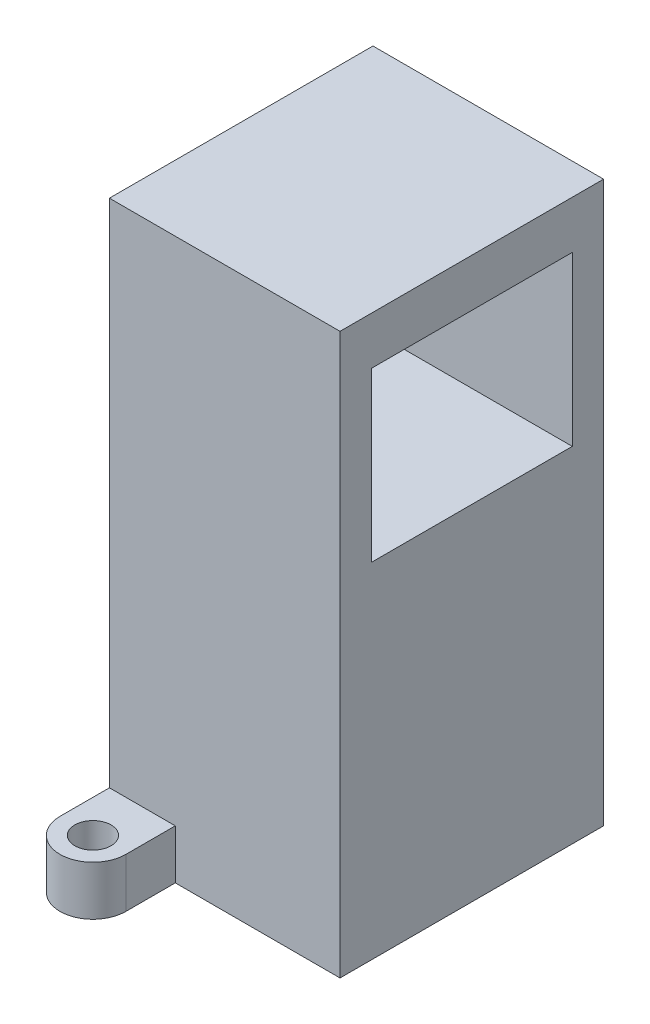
ISO-10303-21;
HEADER;
FILE_DESCRIPTION(('STEP AP214'),'2;1');
FILE_NAME('part.step','',(''),(''),'','','');
FILE_SCHEMA(('AUTOMOTIVE_DESIGN { 1 0 10303 214 1 1 1 1 }'));
ENDSEC;
DATA;
#1=APPLICATION_CONTEXT('core data for automotive mechanical design processes');
#2=APPLICATION_PROTOCOL_DEFINITION('international standard','automotive_design',2000,#1);
#3=PRODUCT_CONTEXT('',#1,'mechanical');
#4=PRODUCT('Part','Part','',(#3));
#5=PRODUCT_RELATED_PRODUCT_CATEGORY('part','',(#4));
#6=PRODUCT_DEFINITION_FORMATION('','',#4);
#7=PRODUCT_DEFINITION_CONTEXT('part definition',#1,'design');
#8=PRODUCT_DEFINITION('design','',#6,#7);
#9=PRODUCT_DEFINITION_SHAPE('','',#8);
#10=(LENGTH_UNIT() NAMED_UNIT(*) SI_UNIT(.MILLI.,.METRE.));
#11=(NAMED_UNIT(*) PLANE_ANGLE_UNIT() SI_UNIT($,.RADIAN.));
#12=(NAMED_UNIT(*) SI_UNIT($,.STERADIAN.) SOLID_ANGLE_UNIT());
#13=UNCERTAINTY_MEASURE_WITH_UNIT(LENGTH_MEASURE(1.E-05),#10,'distance_accuracy_value','');
#14=(GEOMETRIC_REPRESENTATION_CONTEXT(3) GLOBAL_UNCERTAINTY_ASSIGNED_CONTEXT((#13)) GLOBAL_UNIT_ASSIGNED_CONTEXT((#10,
#11,#12)) REPRESENTATION_CONTEXT('',''));
#15=CARTESIAN_POINT('',(0.,0.,0.));
#16=DIRECTION('',(0.,0.,1.));
#17=DIRECTION('',(1.,0.,0.));
#18=AXIS2_PLACEMENT_3D('',#15,#16,#17);
#19=CARTESIAN_POINT('',(-7.,34.,-8.));
#20=DIRECTION('',(0.,0.,1.));
#21=DIRECTION('',(1.,0.,0.));
#22=AXIS2_PLACEMENT_3D('',#19,#20,#21);
#23=PLANE('',#22);
#24=DIRECTION('',(0.,-1.,0.));
#25=VECTOR('',#24,1.);
#26=CARTESIAN_POINT('',(-3.,3.,-8.));
#27=LINE('',#26,#25);
#28=CARTESIAN_POINT('',(-3.,3.,-8.));
#29=VERTEX_POINT('',#28);
#30=CARTESIAN_POINT('',(-3.,0.,-8.));
#31=VERTEX_POINT('',#30);
#32=EDGE_CURVE('E217',#29,#31,#27,.T.);
#33=ORIENTED_EDGE('',*,*,#32,.F.);
#34=DIRECTION('',(1.,0.,0.));
#35=VECTOR('',#34,1.);
#36=CARTESIAN_POINT('',(-3.,3.,-8.));
#37=LINE('',#36,#35);
#38=CARTESIAN_POINT('',(-7.,3.,-8.));
#39=VERTEX_POINT('',#38);
#40=EDGE_CURVE('E59',#39,#29,#37,.T.);
#41=ORIENTED_EDGE('',*,*,#40,.F.);
#42=DIRECTION('',(0.,-1.,0.));
#43=VECTOR('',#42,1.);
#44=CARTESIAN_POINT('',(-7.,34.,-8.));
#45=LINE('',#44,#43);
#46=CARTESIAN_POINT('',(-7.,34.,-8.));
#47=VERTEX_POINT('',#46);
#48=EDGE_CURVE('E44',#47,#39,#45,.T.);
#49=ORIENTED_EDGE('',*,*,#48,.F.);
#50=DIRECTION('',(-1.,0.,0.));
#51=VECTOR('',#50,1.);
#52=CARTESIAN_POINT('',(-7.,34.,-8.));
#53=LINE('',#52,#51);
#54=CARTESIAN_POINT('',(7.,34.,-8.));
#55=VERTEX_POINT('',#54);
#56=EDGE_CURVE('E182',#55,#47,#53,.T.);
#57=ORIENTED_EDGE('',*,*,#56,.F.);
#58=DIRECTION('',(0.,-1.,0.));
#59=VECTOR('',#58,1.);
#60=CARTESIAN_POINT('',(7.,34.,-8.));
#61=LINE('',#60,#59);
#62=CARTESIAN_POINT('',(7.,0.,-8.));
#63=VERTEX_POINT('',#62);
#64=EDGE_CURVE('E11',#55,#63,#61,.T.);
#65=ORIENTED_EDGE('',*,*,#64,.T.);
#66=DIRECTION('',(-1.,0.,0.));
#67=VECTOR('',#66,1.);
#68=CARTESIAN_POINT('',(-7.,0.,-8.));
#69=LINE('',#68,#67);
#70=EDGE_CURVE('E173',#63,#31,#69,.T.);
#71=ORIENTED_EDGE('',*,*,#70,.T.);
#72=EDGE_LOOP('',(#33,#41,#49,#57,#65,#71));
#73=FACE_BOUND('',#72,.T.);
#74=ADVANCED_FACE('F36',(#73),#23,.F.);
#75=CARTESIAN_POINT('',(7.,34.,-8.));
#76=DIRECTION('',(-1.,0.,0.));
#77=DIRECTION('',(0.,0.,1.));
#78=AXIS2_PLACEMENT_3D('',#75,#76,#77);
#79=PLANE('',#78);
#80=DIRECTION('',(0.,0.,1.));
#81=VECTOR('',#80,1.);
#82=CARTESIAN_POINT('',(7.00000000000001,31.1,6.1));
#83=LINE('',#82,#81);
#84=CARTESIAN_POINT('',(7.,31.1,-6.1));
#85=VERTEX_POINT('',#84);
#86=CARTESIAN_POINT('',(7.00000000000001,31.1,6.1));
#87=VERTEX_POINT('',#86);
#88=EDGE_CURVE('E212',#85,#87,#83,.T.);
#89=ORIENTED_EDGE('',*,*,#88,.F.);
#90=DIRECTION('',(0.,1.,0.));
#91=VECTOR('',#90,1.);
#92=CARTESIAN_POINT('',(7.00000000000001,31.1,-6.1));
#93=LINE('',#92,#91);
#94=CARTESIAN_POINT('',(7.00000000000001,20.9,-6.1));
#95=VERTEX_POINT('',#94);
#96=EDGE_CURVE('E215',#95,#85,#93,.T.);
#97=ORIENTED_EDGE('',*,*,#96,.F.);
#98=DIRECTION('',(0.,0.,-1.));
#99=VECTOR('',#98,1.);
#100=CARTESIAN_POINT('',(7.00000000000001,20.9,6.1));
#101=LINE('',#100,#99);
#102=CARTESIAN_POINT('',(7.00000000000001,20.9,6.1));
#103=VERTEX_POINT('',#102);
#104=EDGE_CURVE('E206',#103,#95,#101,.T.);
#105=ORIENTED_EDGE('',*,*,#104,.F.);
#106=DIRECTION('',(0.,-1.,0.));
#107=VECTOR('',#106,1.);
#108=CARTESIAN_POINT('',(7.00000000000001,31.1,6.1));
#109=LINE('',#108,#107);
#110=EDGE_CURVE('E209',#87,#103,#109,.T.);
#111=ORIENTED_EDGE('',*,*,#110,.F.);
#112=EDGE_LOOP('',(#89,#97,#105,#111));
#113=FACE_BOUND('',#112,.T.);
#114=DIRECTION('',(0.,0.,-1.));
#115=VECTOR('',#114,1.);
#116=CARTESIAN_POINT('',(7.,0.,-8.));
#117=LINE('',#116,#115);
#118=CARTESIAN_POINT('',(7.00000000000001,0.,8.));
#119=VERTEX_POINT('',#118);
#120=EDGE_CURVE('E175',#119,#63,#117,.T.);
#121=ORIENTED_EDGE('',*,*,#120,.T.);
#122=ORIENTED_EDGE('',*,*,#64,.F.);
#123=DIRECTION('',(0.,0.,-1.));
#124=VECTOR('',#123,1.);
#125=CARTESIAN_POINT('',(7.,34.,-8.));
#126=LINE('',#125,#124);
#127=CARTESIAN_POINT('',(7.00000000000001,34.,8.));
#128=VERTEX_POINT('',#127);
#129=EDGE_CURVE('E170',#128,#55,#126,.T.);
#130=ORIENTED_EDGE('',*,*,#129,.F.);
#131=DIRECTION('',(0.,-1.,0.));
#132=VECTOR('',#131,1.);
#133=CARTESIAN_POINT('',(7.00000000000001,34.,8.));
#134=LINE('',#133,#132);
#135=EDGE_CURVE('E163',#128,#119,#134,.T.);
#136=ORIENTED_EDGE('',*,*,#135,.T.);
#137=EDGE_LOOP('',(#121,#122,#130,#136));
#138=FACE_BOUND('',#137,.T.);
#139=ADVANCED_FACE('F38',(#113,#138),#79,.F.);
#140=CARTESIAN_POINT('',(-7.,34.,-8.));
#141=DIRECTION('',(1.,0.,0.));
#142=DIRECTION('',(0.,0.,-1.));
#143=AXIS2_PLACEMENT_3D('',#140,#141,#142);
#144=PLANE('',#143);
#145=DIRECTION('',(0.,0.,-1.));
#146=VECTOR('',#145,1.);
#147=CARTESIAN_POINT('',(-7.,20.9,6.1));
#148=LINE('',#147,#146);
#149=CARTESIAN_POINT('',(-7.,20.9,6.1));
#150=VERTEX_POINT('',#149);
#151=CARTESIAN_POINT('',(-7.,20.9,-6.1));
#152=VERTEX_POINT('',#151);
#153=EDGE_CURVE('E190',#150,#152,#148,.T.);
#154=ORIENTED_EDGE('',*,*,#153,.T.);
#155=DIRECTION('',(0.,1.,0.));
#156=VECTOR('',#155,1.);
#157=CARTESIAN_POINT('',(-7.,31.1,-6.1));
#158=LINE('',#157,#156);
#159=CARTESIAN_POINT('',(-7.,31.1,-6.1));
#160=VERTEX_POINT('',#159);
#161=EDGE_CURVE('E203',#152,#160,#158,.T.);
#162=ORIENTED_EDGE('',*,*,#161,.T.);
#163=DIRECTION('',(0.,0.,1.));
#164=VECTOR('',#163,1.);
#165=CARTESIAN_POINT('',(-7.,31.1,6.1));
#166=LINE('',#165,#164);
#167=CARTESIAN_POINT('',(-7.,31.1,6.1));
#168=VERTEX_POINT('',#167);
#169=EDGE_CURVE('E200',#160,#168,#166,.T.);
#170=ORIENTED_EDGE('',*,*,#169,.T.);
#171=DIRECTION('',(0.,-1.,0.));
#172=VECTOR('',#171,1.);
#173=CARTESIAN_POINT('',(-7.,31.1,6.1));
#174=LINE('',#173,#172);
#175=EDGE_CURVE('E197',#168,#150,#174,.T.);
#176=ORIENTED_EDGE('',*,*,#175,.T.);
#177=EDGE_LOOP('',(#154,#162,#170,#176));
#178=FACE_BOUND('',#177,.T.);
#179=DIRECTION('',(0.,0.,1.));
#180=VECTOR('',#179,1.);
#181=CARTESIAN_POINT('',(-7.,0.,-8.));
#182=LINE('',#181,#180);
#183=CARTESIAN_POINT('',(-7.,0.,-11.));
#184=VERTEX_POINT('',#183);
#185=CARTESIAN_POINT('',(-7.,0.,11.));
#186=VERTEX_POINT('',#185);
#187=EDGE_CURVE('E171',#184,#186,#182,.T.);
#188=ORIENTED_EDGE('',*,*,#187,.T.);
#189=DIRECTION('',(0.,-1.,0.));
#190=VECTOR('',#189,1.);
#191=CARTESIAN_POINT('',(-7.,3.,11.));
#192=LINE('',#191,#190);
#193=CARTESIAN_POINT('',(-7.,3.,11.));
#194=VERTEX_POINT('',#193);
#195=EDGE_CURVE('E157',#194,#186,#192,.T.);
#196=ORIENTED_EDGE('',*,*,#195,.F.);
#197=DIRECTION('',(0.,0.,-1.));
#198=VECTOR('',#197,1.);
#199=CARTESIAN_POINT('',(-7.,3.,8.));
#200=LINE('',#199,#198);
#201=CARTESIAN_POINT('',(-7.,3.,8.));
#202=VERTEX_POINT('',#201);
#203=EDGE_CURVE('E143',#194,#202,#200,.T.);
#204=ORIENTED_EDGE('',*,*,#203,.T.);
#205=DIRECTION('',(0.,-1.,0.));
#206=VECTOR('',#205,1.);
#207=CARTESIAN_POINT('',(-6.99999999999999,34.,8.));
#208=LINE('',#207,#206);
#209=CARTESIAN_POINT('',(-6.99999999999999,34.,8.));
#210=VERTEX_POINT('',#209);
#211=EDGE_CURVE('E154',#210,#202,#208,.T.);
#212=ORIENTED_EDGE('',*,*,#211,.F.);
#213=DIRECTION('',(0.,0.,1.));
#214=VECTOR('',#213,1.);
#215=CARTESIAN_POINT('',(-7.,34.,-8.));
#216=LINE('',#215,#214);
#217=EDGE_CURVE('E180',#47,#210,#216,.T.);
#218=ORIENTED_EDGE('',*,*,#217,.F.);
#219=ORIENTED_EDGE('',*,*,#48,.T.);
#220=DIRECTION('',(0.,0.,1.));
#221=VECTOR('',#220,1.);
#222=CARTESIAN_POINT('',(-7.,3.,-8.));
#223=LINE('',#222,#221);
#224=CARTESIAN_POINT('',(-7.,3.,-11.));
#225=VERTEX_POINT('',#224);
#226=EDGE_CURVE('E226',#225,#39,#223,.T.);
#227=ORIENTED_EDGE('',*,*,#226,.F.);
#228=DIRECTION('',(0.,-1.,0.));
#229=VECTOR('',#228,1.);
#230=CARTESIAN_POINT('',(-7.,3.,-11.));
#231=LINE('',#230,#229);
#232=EDGE_CURVE('E223',#225,#184,#231,.T.);
#233=ORIENTED_EDGE('',*,*,#232,.T.);
#234=EDGE_LOOP('',(#188,#196,#204,#212,#218,#219,#227,#233));
#235=FACE_BOUND('',#234,.T.);
#236=ADVANCED_FACE('F152',(#178,#235),#144,.F.);
#237=CARTESIAN_POINT('',(-6.99999999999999,34.,8.));
#238=DIRECTION('',(0.,0.,-1.));
#239=DIRECTION('',(-1.,0.,0.));
#240=AXIS2_PLACEMENT_3D('',#237,#238,#239);
#241=PLANE('',#240);
#242=ORIENTED_EDGE('',*,*,#211,.T.);
#243=DIRECTION('',(1.,0.,0.));
#244=VECTOR('',#243,1.);
#245=CARTESIAN_POINT('',(-3.,3.,8.));
#246=LINE('',#245,#244);
#247=CARTESIAN_POINT('',(-3.,3.,8.));
#248=VERTEX_POINT('',#247);
#249=EDGE_CURVE('E139',#202,#248,#246,.T.);
#250=ORIENTED_EDGE('',*,*,#249,.T.);
#251=DIRECTION('',(0.,-1.,0.));
#252=VECTOR('',#251,1.);
#253=CARTESIAN_POINT('',(-3.,3.,8.));
#254=LINE('',#253,#252);
#255=CARTESIAN_POINT('',(-3.,0.,8.));
#256=VERTEX_POINT('',#255);
#257=EDGE_CURVE('E248',#248,#256,#254,.T.);
#258=ORIENTED_EDGE('',*,*,#257,.T.);
#259=DIRECTION('',(1.,0.,0.));
#260=VECTOR('',#259,1.);
#261=CARTESIAN_POINT('',(-6.99999999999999,0.,8.));
#262=LINE('',#261,#260);
#263=EDGE_CURVE('E168',#256,#119,#262,.T.);
#264=ORIENTED_EDGE('',*,*,#263,.T.);
#265=ORIENTED_EDGE('',*,*,#135,.F.);
#266=DIRECTION('',(1.,0.,0.));
#267=VECTOR('',#266,1.);
#268=CARTESIAN_POINT('',(-6.99999999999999,34.,8.));
#269=LINE('',#268,#267);
#270=EDGE_CURVE('E162',#210,#128,#269,.T.);
#271=ORIENTED_EDGE('',*,*,#270,.F.);
#272=EDGE_LOOP('',(#242,#250,#258,#264,#265,#271));
#273=FACE_BOUND('',#272,.T.);
#274=ADVANCED_FACE('F160',(#273),#241,.F.);
#275=CARTESIAN_POINT('',(0.,34.,0.));
#276=DIRECTION('',(0.,1.,0.));
#277=DIRECTION('',(0.,0.,1.));
#278=AXIS2_PLACEMENT_3D('',#275,#276,#277);
#279=PLANE('',#278);
#280=ORIENTED_EDGE('',*,*,#129,.T.);
#281=ORIENTED_EDGE('',*,*,#56,.T.);
#282=ORIENTED_EDGE('',*,*,#217,.T.);
#283=ORIENTED_EDGE('',*,*,#270,.T.);
#284=EDGE_LOOP('',(#280,#281,#282,#283));
#285=FACE_BOUND('',#284,.T.);
#286=ADVANCED_FACE('F273',(#285),#279,.T.);
#287=CARTESIAN_POINT('',(0.,0.,0.));
#288=DIRECTION('',(0.,1.,0.));
#289=DIRECTION('',(0.,0.,1.));
#290=AXIS2_PLACEMENT_3D('',#287,#288,#289);
#291=PLANE('',#290);
#292=ORIENTED_EDGE('',*,*,#120,.F.);
#293=ORIENTED_EDGE('',*,*,#263,.F.);
#294=DIRECTION('',(0.,0.,1.));
#295=VECTOR('',#294,1.);
#296=CARTESIAN_POINT('',(-3.,0.,11.));
#297=LINE('',#296,#295);
#298=CARTESIAN_POINT('',(-3.,0.,11.));
#299=VERTEX_POINT('',#298);
#300=EDGE_CURVE('E51',#256,#299,#297,.T.);
#301=ORIENTED_EDGE('',*,*,#300,.T.);
#302=CARTESIAN_POINT('',(-5.,0.,11.));
#303=DIRECTION('',(0.,-1.,0.));
#304=DIRECTION('',(0.,0.,-1.));
#305=AXIS2_PLACEMENT_3D('',#302,#303,#304);
#306=CIRCLE('',#305,2.);
#307=EDGE_CURVE('E251',#299,#186,#306,.T.);
#308=ORIENTED_EDGE('',*,*,#307,.T.);
#309=ORIENTED_EDGE('',*,*,#187,.F.);
#310=CARTESIAN_POINT('',(-5.,0.,-11.));
#311=DIRECTION('',(0.,1.,0.));
#312=DIRECTION('',(0.,0.,1.));
#313=AXIS2_PLACEMENT_3D('',#310,#311,#312);
#314=CIRCLE('',#313,2.);
#315=CARTESIAN_POINT('',(-3.,0.,-11.));
#316=VERTEX_POINT('',#315);
#317=EDGE_CURVE('E227',#316,#184,#314,.T.);
#318=ORIENTED_EDGE('',*,*,#317,.F.);
#319=DIRECTION('',(0.,0.,-1.));
#320=VECTOR('',#319,1.);
#321=CARTESIAN_POINT('',(-3.,0.,-11.));
#322=LINE('',#321,#320);
#323=EDGE_CURVE('E230',#31,#316,#322,.T.);
#324=ORIENTED_EDGE('',*,*,#323,.F.);
#325=ORIENTED_EDGE('',*,*,#70,.F.);
#326=EDGE_LOOP('',(#292,#293,#301,#308,#309,#318,#324,#325));
#327=FACE_BOUND('',#326,.T.);
#328=CARTESIAN_POINT('',(-5.,0.,-11.));
#329=DIRECTION('',(0.,1.,0.));
#330=DIRECTION('',(0.,0.,1.));
#331=AXIS2_PLACEMENT_3D('',#328,#329,#330);
#332=CIRCLE('',#331,1.1);
#333=CARTESIAN_POINT('',(-5.,0.,-9.9));
#334=VERTEX_POINT('',#333);
#335=EDGE_CURVE('E240',#334,#334,#332,.T.);
#336=ORIENTED_EDGE('',*,*,#335,.T.);
#337=EDGE_LOOP('',(#336));
#338=FACE_BOUND('',#337,.T.);
#339=CARTESIAN_POINT('',(-5.,0.,11.));
#340=DIRECTION('',(0.,-1.,0.));
#341=DIRECTION('',(0.,0.,-1.));
#342=AXIS2_PLACEMENT_3D('',#339,#340,#341);
#343=CIRCLE('',#342,1.1);
#344=CARTESIAN_POINT('',(-5.,0.,9.9));
#345=VERTEX_POINT('',#344);
#346=EDGE_CURVE('E257',#345,#345,#343,.T.);
#347=ORIENTED_EDGE('',*,*,#346,.F.);
#348=EDGE_LOOP('',(#347));
#349=FACE_BOUND('',#348,.T.);
#350=ADVANCED_FACE('F270',(#327,#338,#349),#291,.F.);
#351=CARTESIAN_POINT('',(-7.,31.1,-6.1));
#352=DIRECTION('',(0.,0.,-1.));
#353=DIRECTION('',(0.,1.,0.));
#354=AXIS2_PLACEMENT_3D('',#351,#352,#353);
#355=PLANE('',#354);
#356=DIRECTION('',(1.,0.,0.));
#357=VECTOR('',#356,1.);
#358=CARTESIAN_POINT('',(-7.,31.1,-6.1));
#359=LINE('',#358,#357);
#360=EDGE_CURVE('E186',#160,#85,#359,.T.);
#361=ORIENTED_EDGE('',*,*,#360,.F.);
#362=ORIENTED_EDGE('',*,*,#161,.F.);
#363=DIRECTION('',(1.,0.,0.));
#364=VECTOR('',#363,1.);
#365=CARTESIAN_POINT('',(-7.,20.9,-6.1));
#366=LINE('',#365,#364);
#367=EDGE_CURVE('E178',#152,#95,#366,.T.);
#368=ORIENTED_EDGE('',*,*,#367,.T.);
#369=ORIENTED_EDGE('',*,*,#96,.T.);
#370=EDGE_LOOP('',(#361,#362,#368,#369));
#371=FACE_BOUND('',#370,.T.);
#372=ADVANCED_FACE('F272',(#371),#355,.F.);
#373=CARTESIAN_POINT('',(-7.,20.9,6.1));
#374=DIRECTION('',(0.,-1.,0.));
#375=DIRECTION('',(0.,0.,-1.));
#376=AXIS2_PLACEMENT_3D('',#373,#374,#375);
#377=PLANE('',#376);
#378=ORIENTED_EDGE('',*,*,#367,.F.);
#379=ORIENTED_EDGE('',*,*,#153,.F.);
#380=DIRECTION('',(1.,0.,0.));
#381=VECTOR('',#380,1.);
#382=CARTESIAN_POINT('',(-7.,20.9,6.1));
#383=LINE('',#382,#381);
#384=EDGE_CURVE('E192',#150,#103,#383,.T.);
#385=ORIENTED_EDGE('',*,*,#384,.T.);
#386=ORIENTED_EDGE('',*,*,#104,.T.);
#387=EDGE_LOOP('',(#378,#379,#385,#386));
#388=FACE_BOUND('',#387,.T.);
#389=ADVANCED_FACE('F280',(#388),#377,.F.);
#390=CARTESIAN_POINT('',(-7.,31.1,6.1));
#391=DIRECTION('',(0.,0.,1.));
#392=DIRECTION('',(0.,-1.,0.));
#393=AXIS2_PLACEMENT_3D('',#390,#391,#392);
#394=PLANE('',#393);
#395=ORIENTED_EDGE('',*,*,#384,.F.);
#396=ORIENTED_EDGE('',*,*,#175,.F.);
#397=DIRECTION('',(1.,0.,0.));
#398=VECTOR('',#397,1.);
#399=CARTESIAN_POINT('',(-7.,31.1,6.1));
#400=LINE('',#399,#398);
#401=EDGE_CURVE('E189',#168,#87,#400,.T.);
#402=ORIENTED_EDGE('',*,*,#401,.T.);
#403=ORIENTED_EDGE('',*,*,#110,.T.);
#404=EDGE_LOOP('',(#395,#396,#402,#403));
#405=FACE_BOUND('',#404,.T.);
#406=ADVANCED_FACE('F328',(#405),#394,.F.);
#407=CARTESIAN_POINT('',(-7.,31.1,6.1));
#408=DIRECTION('',(0.,1.,0.));
#409=DIRECTION('',(0.,0.,1.));
#410=AXIS2_PLACEMENT_3D('',#407,#408,#409);
#411=PLANE('',#410);
#412=ORIENTED_EDGE('',*,*,#401,.F.);
#413=ORIENTED_EDGE('',*,*,#169,.F.);
#414=ORIENTED_EDGE('',*,*,#360,.T.);
#415=ORIENTED_EDGE('',*,*,#88,.T.);
#416=EDGE_LOOP('',(#412,#413,#414,#415));
#417=FACE_BOUND('',#416,.T.);
#418=ADVANCED_FACE('F338',(#417),#411,.F.);
#419=CARTESIAN_POINT('',(-5.,3.,-11.));
#420=DIRECTION('',(0.,1.,0.));
#421=DIRECTION('',(0.,0.,1.));
#422=AXIS2_PLACEMENT_3D('',#419,#420,#421);
#423=PLANE('',#422);
#424=ORIENTED_EDGE('',*,*,#40,.T.);
#425=DIRECTION('',(0.,0.,-1.));
#426=VECTOR('',#425,1.);
#427=CARTESIAN_POINT('',(-3.,3.,-11.));
#428=LINE('',#427,#426);
#429=CARTESIAN_POINT('',(-3.,3.,-11.));
#430=VERTEX_POINT('',#429);
#431=EDGE_CURVE('E237',#29,#430,#428,.T.);
#432=ORIENTED_EDGE('',*,*,#431,.T.);
#433=CARTESIAN_POINT('',(-5.,3.,-11.));
#434=DIRECTION('',(0.,1.,0.));
#435=DIRECTION('',(0.,0.,1.));
#436=AXIS2_PLACEMENT_3D('',#433,#434,#435);
#437=CIRCLE('',#436,2.);
#438=EDGE_CURVE('E235',#430,#225,#437,.T.);
#439=ORIENTED_EDGE('',*,*,#438,.T.);
#440=ORIENTED_EDGE('',*,*,#226,.T.);
#441=EDGE_LOOP('',(#424,#432,#439,#440));
#442=FACE_BOUND('',#441,.T.);
#443=CARTESIAN_POINT('',(-5.,3.,-11.));
#444=DIRECTION('',(0.,1.,0.));
#445=DIRECTION('',(0.,0.,1.));
#446=AXIS2_PLACEMENT_3D('',#443,#444,#445);
#447=CIRCLE('',#446,1.1);
#448=CARTESIAN_POINT('',(-5.,3.,-9.9));
#449=VERTEX_POINT('',#448);
#450=EDGE_CURVE('E232',#449,#449,#447,.T.);
#451=ORIENTED_EDGE('',*,*,#450,.F.);
#452=EDGE_LOOP('',(#451));
#453=FACE_BOUND('',#452,.T.);
#454=ADVANCED_FACE('F347',(#442,#453),#423,.T.);
#455=CARTESIAN_POINT('',(-3.,3.,-11.));
#456=DIRECTION('',(-1.,0.,0.));
#457=DIRECTION('',(0.,0.,1.));
#458=AXIS2_PLACEMENT_3D('',#455,#456,#457);
#459=PLANE('',#458);
#460=ORIENTED_EDGE('',*,*,#323,.T.);
#461=DIRECTION('',(0.,-1.,0.));
#462=VECTOR('',#461,1.);
#463=CARTESIAN_POINT('',(-3.,3.,-11.));
#464=LINE('',#463,#462);
#465=EDGE_CURVE('E220',#430,#316,#464,.T.);
#466=ORIENTED_EDGE('',*,*,#465,.F.);
#467=ORIENTED_EDGE('',*,*,#431,.F.);
#468=ORIENTED_EDGE('',*,*,#32,.T.);
#469=EDGE_LOOP('',(#460,#466,#467,#468));
#470=FACE_BOUND('',#469,.T.);
#471=ADVANCED_FACE('F363',(#470),#459,.F.);
#472=CARTESIAN_POINT('',(-5.,3.,-11.));
#473=DIRECTION('',(0.,-1.,0.));
#474=DIRECTION('',(0.,0.,-1.));
#475=AXIS2_PLACEMENT_3D('',#472,#473,#474);
#476=CYLINDRICAL_SURFACE('',#475,2.);
#477=ORIENTED_EDGE('',*,*,#317,.T.);
#478=ORIENTED_EDGE('',*,*,#232,.F.);
#479=ORIENTED_EDGE('',*,*,#438,.F.);
#480=ORIENTED_EDGE('',*,*,#465,.T.);
#481=EDGE_LOOP('',(#477,#478,#479,#480));
#482=FACE_BOUND('',#481,.T.);
#483=ADVANCED_FACE('F374',(#482),#476,.T.);
#484=CARTESIAN_POINT('',(-5.,3.,-11.));
#485=DIRECTION('',(0.,-1.,0.));
#486=DIRECTION('',(0.,0.,-1.));
#487=AXIS2_PLACEMENT_3D('',#484,#485,#486);
#488=CYLINDRICAL_SURFACE('',#487,1.1);
#489=ORIENTED_EDGE('',*,*,#450,.T.);
#490=EDGE_LOOP('',(#489));
#491=FACE_BOUND('',#490,.T.);
#492=ORIENTED_EDGE('',*,*,#335,.F.);
#493=EDGE_LOOP('',(#492));
#494=FACE_BOUND('',#493,.T.);
#495=ADVANCED_FACE('F384',(#491,#494),#488,.F.);
#496=CARTESIAN_POINT('',(-5.,3.,11.));
#497=DIRECTION('',(0.,-1.,0.));
#498=DIRECTION('',(0.,0.,-1.));
#499=AXIS2_PLACEMENT_3D('',#496,#497,#498);
#500=CYLINDRICAL_SURFACE('',#499,2.);
#501=ORIENTED_EDGE('',*,*,#307,.F.);
#502=DIRECTION('',(0.,-1.,0.));
#503=VECTOR('',#502,1.);
#504=CARTESIAN_POINT('',(-3.,3.,11.));
#505=LINE('',#504,#503);
#506=CARTESIAN_POINT('',(-3.,3.,11.));
#507=VERTEX_POINT('',#506);
#508=EDGE_CURVE('E246',#507,#299,#505,.T.);
#509=ORIENTED_EDGE('',*,*,#508,.F.);
#510=CARTESIAN_POINT('',(-5.,3.,11.));
#511=DIRECTION('',(0.,-1.,0.));
#512=DIRECTION('',(0.,0.,-1.));
#513=AXIS2_PLACEMENT_3D('',#510,#511,#512);
#514=CIRCLE('',#513,2.);
#515=EDGE_CURVE('E158',#507,#194,#514,.T.);
#516=ORIENTED_EDGE('',*,*,#515,.T.);
#517=ORIENTED_EDGE('',*,*,#195,.T.);
#518=EDGE_LOOP('',(#501,#509,#516,#517));
#519=FACE_BOUND('',#518,.T.);
#520=ADVANCED_FACE('F393',(#519),#500,.T.);
#521=CARTESIAN_POINT('',(-3.,3.,11.));
#522=DIRECTION('',(1.,0.,0.));
#523=DIRECTION('',(0.,0.,-1.));
#524=AXIS2_PLACEMENT_3D('',#521,#522,#523);
#525=PLANE('',#524);
#526=ORIENTED_EDGE('',*,*,#300,.F.);
#527=ORIENTED_EDGE('',*,*,#257,.F.);
#528=DIRECTION('',(0.,0.,1.));
#529=VECTOR('',#528,1.);
#530=CARTESIAN_POINT('',(-3.,3.,11.));
#531=LINE('',#530,#529);
#532=EDGE_CURVE('E146',#248,#507,#531,.T.);
#533=ORIENTED_EDGE('',*,*,#532,.T.);
#534=ORIENTED_EDGE('',*,*,#508,.T.);
#535=EDGE_LOOP('',(#526,#527,#533,#534));
#536=FACE_BOUND('',#535,.T.);
#537=ADVANCED_FACE('F417',(#536),#525,.T.);
#538=CARTESIAN_POINT('',(-5.,3.,11.));
#539=DIRECTION('',(0.,1.,0.));
#540=DIRECTION('',(0.,0.,-1.));
#541=AXIS2_PLACEMENT_3D('',#538,#539,#540);
#542=PLANE('',#541);
#543=CARTESIAN_POINT('',(-5.,3.,11.));
#544=DIRECTION('',(0.,-1.,0.));
#545=DIRECTION('',(0.,0.,-1.));
#546=AXIS2_PLACEMENT_3D('',#543,#544,#545);
#547=CIRCLE('',#546,1.1);
#548=CARTESIAN_POINT('',(-5.,3.,9.9));
#549=VERTEX_POINT('',#548);
#550=EDGE_CURVE('E254',#549,#549,#547,.T.);
#551=ORIENTED_EDGE('',*,*,#550,.T.);
#552=EDGE_LOOP('',(#551));
#553=FACE_BOUND('',#552,.T.);
#554=ORIENTED_EDGE('',*,*,#249,.F.);
#555=ORIENTED_EDGE('',*,*,#203,.F.);
#556=ORIENTED_EDGE('',*,*,#515,.F.);
#557=ORIENTED_EDGE('',*,*,#532,.F.);
#558=EDGE_LOOP('',(#554,#555,#556,#557));
#559=FACE_BOUND('',#558,.T.);
#560=ADVANCED_FACE('F141',(#553,#559),#542,.T.);
#561=CARTESIAN_POINT('',(-5.,3.,11.));
#562=DIRECTION('',(0.,-1.,0.));
#563=DIRECTION('',(0.,0.,-1.));
#564=AXIS2_PLACEMENT_3D('',#561,#562,#563);
#565=CYLINDRICAL_SURFACE('',#564,1.1);
#566=ORIENTED_EDGE('',*,*,#550,.F.);
#567=EDGE_LOOP('',(#566));
#568=FACE_BOUND('',#567,.T.);
#569=ORIENTED_EDGE('',*,*,#346,.T.);
#570=EDGE_LOOP('',(#569));
#571=FACE_BOUND('',#570,.T.);
#572=ADVANCED_FACE('F264',(#568,#571),#565,.F.);
#573=CLOSED_SHELL('',(#74,#139,#236,#274,#286,#350,#372,#389,#406,#418,#454,#471,#483,#495,#520,
#537,#560,#572));
#574=MANIFOLD_SOLID_BREP('B2',#573);
#575=ADVANCED_BREP_SHAPE_REPRESENTATION('',(#18,#574),#14);
#576=SHAPE_DEFINITION_REPRESENTATION(#9,#575);
ENDSEC;
END-ISO-10303-21;
